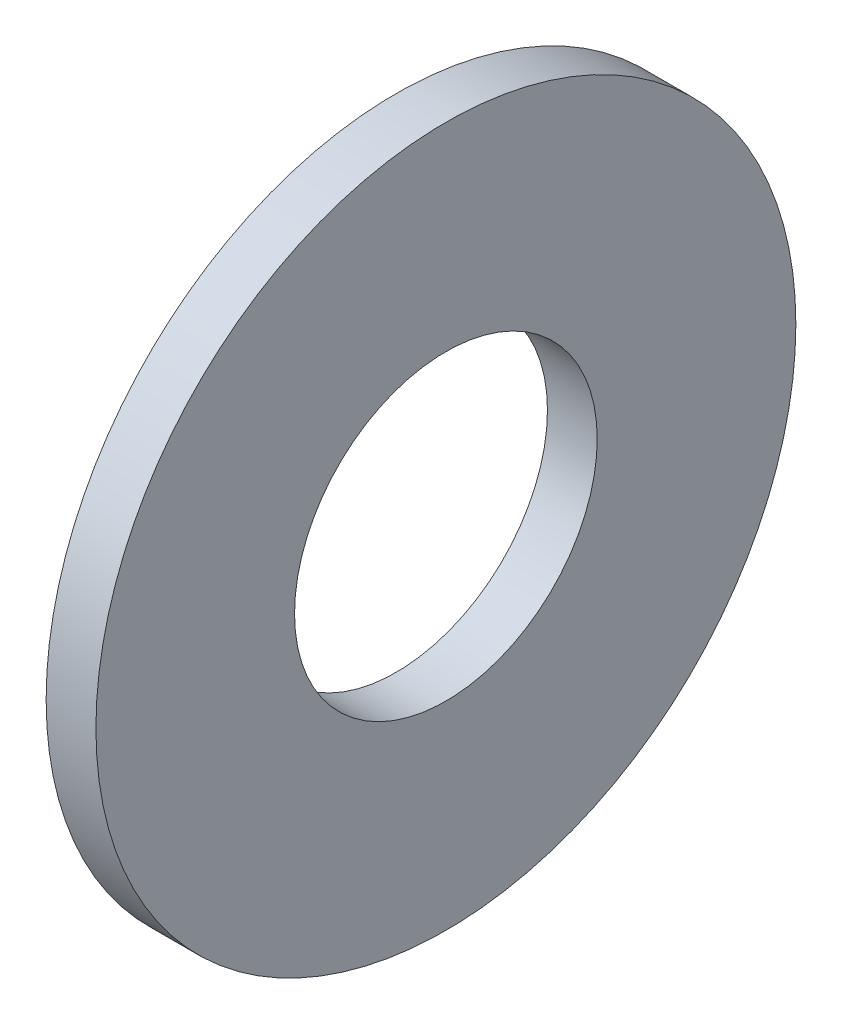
from build123d import *

# Parameters (mm, degrees)
SKETCH1_W = 6.4
SKETCH1_H = 25.54


with BuildPart() as part:
    # Sketch1 → Base-Revolve (revolve)
    with BuildSketch(Plane.XY, mode=Mode.PRIVATE) as base_revolve_sk:
        with Locations((-3.2, 32.23)):
            Rectangle(SKETCH1_W, SKETCH1_H)
    revolve(base_revolve_sk.sketch.rotate(Axis((-34.925, 0, 0), (1, 0, 0)), 90), axis=Axis((-34.925, 0, 0), (1, 0, 0)))


solid = part.part
